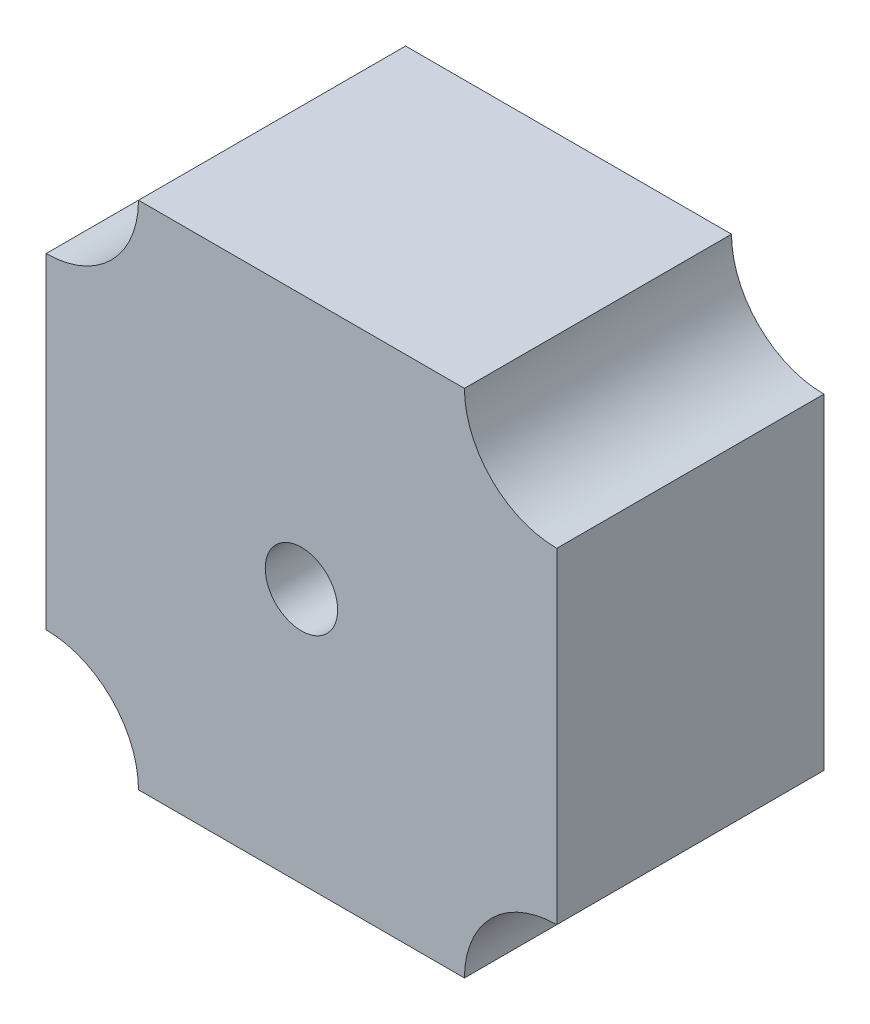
ISO-10303-21;
HEADER;
FILE_DESCRIPTION(('STEP AP214'),'2;1');
FILE_NAME('part.step','',(''),(''),'','','');
FILE_SCHEMA(('AUTOMOTIVE_DESIGN { 1 0 10303 214 1 1 1 1 }'));
ENDSEC;
DATA;
#1=APPLICATION_CONTEXT('core data for automotive mechanical design processes');
#2=APPLICATION_PROTOCOL_DEFINITION('international standard','automotive_design',2000,#1);
#3=PRODUCT_CONTEXT('',#1,'mechanical');
#4=PRODUCT('Part','Part','',(#3));
#5=PRODUCT_RELATED_PRODUCT_CATEGORY('part','',(#4));
#6=PRODUCT_DEFINITION_FORMATION('','',#4);
#7=PRODUCT_DEFINITION_CONTEXT('part definition',#1,'design');
#8=PRODUCT_DEFINITION('design','',#6,#7);
#9=PRODUCT_DEFINITION_SHAPE('','',#8);
#10=(LENGTH_UNIT() NAMED_UNIT(*) SI_UNIT(.MILLI.,.METRE.));
#11=(NAMED_UNIT(*) PLANE_ANGLE_UNIT() SI_UNIT($,.RADIAN.));
#12=(NAMED_UNIT(*) SI_UNIT($,.STERADIAN.) SOLID_ANGLE_UNIT());
#13=UNCERTAINTY_MEASURE_WITH_UNIT(LENGTH_MEASURE(1.E-05),#10,'distance_accuracy_value','');
#14=(GEOMETRIC_REPRESENTATION_CONTEXT(3) GLOBAL_UNCERTAINTY_ASSIGNED_CONTEXT((#13)) GLOBAL_UNIT_ASSIGNED_CONTEXT((#10,
#11,#12)) REPRESENTATION_CONTEXT('',''));
#15=CARTESIAN_POINT('',(0.,0.,0.));
#16=DIRECTION('',(0.,0.,1.));
#17=DIRECTION('',(1.,0.,0.));
#18=AXIS2_PLACEMENT_3D('',#15,#16,#17);
#19=CARTESIAN_POINT('',(-28.2,28.2,29.5));
#20=DIRECTION('',(0.,0.,-1.));
#21=DIRECTION('',(-1.,0.,0.));
#22=AXIS2_PLACEMENT_3D('',#19,#20,#21);
#23=CYLINDRICAL_SURFACE('',#22,10.2);
#24=CARTESIAN_POINT('',(-28.2,28.2,0.));
#25=DIRECTION('',(0.,0.,-1.));
#26=DIRECTION('',(1.,0.,0.));
#27=AXIS2_PLACEMENT_3D('',#24,#25,#26);
#28=CIRCLE('',#27,10.2);
#29=CARTESIAN_POINT('',(-18.,28.2,0.));
#30=VERTEX_POINT('',#29);
#31=CARTESIAN_POINT('',(-28.2,18.,0.));
#32=VERTEX_POINT('',#31);
#33=EDGE_CURVE('E129',#30,#32,#28,.T.);
#34=ORIENTED_EDGE('',*,*,#33,.T.);
#35=DIRECTION('',(0.,0.,-1.));
#36=VECTOR('',#35,1.);
#37=CARTESIAN_POINT('',(-28.2,18.,29.5));
#38=LINE('',#37,#36);
#39=CARTESIAN_POINT('',(-28.2,18.,29.5));
#40=VERTEX_POINT('',#39);
#41=EDGE_CURVE('E11',#40,#32,#38,.T.);
#42=ORIENTED_EDGE('',*,*,#41,.F.);
#43=CARTESIAN_POINT('',(-28.2,28.2,29.5));
#44=DIRECTION('',(0.,0.,-1.));
#45=DIRECTION('',(1.,0.,0.));
#46=AXIS2_PLACEMENT_3D('',#43,#44,#45);
#47=CIRCLE('',#46,10.2);
#48=CARTESIAN_POINT('',(-18.,28.2,29.5));
#49=VERTEX_POINT('',#48);
#50=EDGE_CURVE('E144',#49,#40,#47,.T.);
#51=ORIENTED_EDGE('',*,*,#50,.F.);
#52=DIRECTION('',(0.,0.,-1.));
#53=VECTOR('',#52,1.);
#54=CARTESIAN_POINT('',(-18.,28.2,29.5));
#55=LINE('',#54,#53);
#56=EDGE_CURVE('E125',#49,#30,#55,.T.);
#57=ORIENTED_EDGE('',*,*,#56,.T.);
#58=EDGE_LOOP('',(#34,#42,#51,#57));
#59=FACE_BOUND('',#58,.T.);
#60=ADVANCED_FACE('F33',(#59),#23,.F.);
#61=CARTESIAN_POINT('',(-28.2,-18.,29.5));
#62=DIRECTION('',(1.,0.,0.));
#63=DIRECTION('',(0.,0.,-1.));
#64=AXIS2_PLACEMENT_3D('',#61,#62,#63);
#65=PLANE('',#64);
#66=DIRECTION('',(0.,-1.,0.));
#67=VECTOR('',#66,1.);
#68=CARTESIAN_POINT('',(-28.2,-18.,0.));
#69=LINE('',#68,#67);
#70=CARTESIAN_POINT('',(-28.2,-18.,0.));
#71=VERTEX_POINT('',#70);
#72=EDGE_CURVE('E132',#32,#71,#69,.T.);
#73=ORIENTED_EDGE('',*,*,#72,.T.);
#74=DIRECTION('',(0.,0.,-1.));
#75=VECTOR('',#74,1.);
#76=CARTESIAN_POINT('',(-28.2,-18.,29.5));
#77=LINE('',#76,#75);
#78=CARTESIAN_POINT('',(-28.2,-18.,29.5));
#79=VERTEX_POINT('',#78);
#80=EDGE_CURVE('E41',#79,#71,#77,.T.);
#81=ORIENTED_EDGE('',*,*,#80,.F.);
#82=DIRECTION('',(0.,-1.,0.));
#83=VECTOR('',#82,1.);
#84=CARTESIAN_POINT('',(-28.2,-18.,29.5));
#85=LINE('',#84,#83);
#86=EDGE_CURVE('E92',#40,#79,#85,.T.);
#87=ORIENTED_EDGE('',*,*,#86,.F.);
#88=ORIENTED_EDGE('',*,*,#41,.T.);
#89=EDGE_LOOP('',(#73,#81,#87,#88));
#90=FACE_BOUND('',#89,.T.);
#91=ADVANCED_FACE('F199',(#90),#65,.F.);
#92=CARTESIAN_POINT('',(-28.2,-28.2,29.5));
#93=DIRECTION('',(0.,0.,-1.));
#94=DIRECTION('',(-1.,0.,0.));
#95=AXIS2_PLACEMENT_3D('',#92,#93,#94);
#96=CYLINDRICAL_SURFACE('',#95,10.2);
#97=CARTESIAN_POINT('',(-28.2,-28.2,0.));
#98=DIRECTION('',(0.,0.,-1.));
#99=DIRECTION('',(1.,0.,0.));
#100=AXIS2_PLACEMENT_3D('',#97,#98,#99);
#101=CIRCLE('',#100,10.2);
#102=CARTESIAN_POINT('',(-18.,-28.2,0.));
#103=VERTEX_POINT('',#102);
#104=EDGE_CURVE('E135',#71,#103,#101,.T.);
#105=ORIENTED_EDGE('',*,*,#104,.T.);
#106=DIRECTION('',(0.,0.,-1.));
#107=VECTOR('',#106,1.);
#108=CARTESIAN_POINT('',(-18.,-28.2,29.5));
#109=LINE('',#108,#107);
#110=CARTESIAN_POINT('',(-18.,-28.2,29.5));
#111=VERTEX_POINT('',#110);
#112=EDGE_CURVE('E151',#111,#103,#109,.T.);
#113=ORIENTED_EDGE('',*,*,#112,.F.);
#114=CARTESIAN_POINT('',(-28.2,-28.2,29.5));
#115=DIRECTION('',(0.,0.,-1.));
#116=DIRECTION('',(1.,0.,0.));
#117=AXIS2_PLACEMENT_3D('',#114,#115,#116);
#118=CIRCLE('',#117,10.2);
#119=EDGE_CURVE('E159',#79,#111,#118,.T.);
#120=ORIENTED_EDGE('',*,*,#119,.F.);
#121=ORIENTED_EDGE('',*,*,#80,.T.);
#122=EDGE_LOOP('',(#105,#113,#120,#121));
#123=FACE_BOUND('',#122,.T.);
#124=ADVANCED_FACE('F157',(#123),#96,.F.);
#125=CARTESIAN_POINT('',(18.,-28.2,29.5));
#126=DIRECTION('',(0.,1.,0.));
#127=DIRECTION('',(0.,0.,1.));
#128=AXIS2_PLACEMENT_3D('',#125,#126,#127);
#129=PLANE('',#128);
#130=DIRECTION('',(1.,0.,0.));
#131=VECTOR('',#130,1.);
#132=CARTESIAN_POINT('',(18.,-28.2,0.));
#133=LINE('',#132,#131);
#134=CARTESIAN_POINT('',(18.,-28.2,0.));
#135=VERTEX_POINT('',#134);
#136=EDGE_CURVE('E137',#103,#135,#133,.T.);
#137=ORIENTED_EDGE('',*,*,#136,.T.);
#138=DIRECTION('',(0.,0.,-1.));
#139=VECTOR('',#138,1.);
#140=CARTESIAN_POINT('',(18.,-28.2,29.5));
#141=LINE('',#140,#139);
#142=CARTESIAN_POINT('',(18.,-28.2,29.5));
#143=VERTEX_POINT('',#142);
#144=EDGE_CURVE('E148',#143,#135,#141,.T.);
#145=ORIENTED_EDGE('',*,*,#144,.F.);
#146=DIRECTION('',(1.,0.,0.));
#147=VECTOR('',#146,1.);
#148=CARTESIAN_POINT('',(18.,-28.2,29.5));
#149=LINE('',#148,#147);
#150=EDGE_CURVE('E171',#111,#143,#149,.T.);
#151=ORIENTED_EDGE('',*,*,#150,.F.);
#152=ORIENTED_EDGE('',*,*,#112,.T.);
#153=EDGE_LOOP('',(#137,#145,#151,#152));
#154=FACE_BOUND('',#153,.T.);
#155=ADVANCED_FACE('F167',(#154),#129,.F.);
#156=CARTESIAN_POINT('',(28.2,-28.2,29.5));
#157=DIRECTION('',(0.,0.,-1.));
#158=DIRECTION('',(-1.,0.,0.));
#159=AXIS2_PLACEMENT_3D('',#156,#157,#158);
#160=CYLINDRICAL_SURFACE('',#159,10.2);
#161=CARTESIAN_POINT('',(28.2,-28.2,0.));
#162=DIRECTION('',(0.,0.,-1.));
#163=DIRECTION('',(1.,0.,0.));
#164=AXIS2_PLACEMENT_3D('',#161,#162,#163);
#165=CIRCLE('',#164,10.2);
#166=CARTESIAN_POINT('',(28.2,-18.,0.));
#167=VERTEX_POINT('',#166);
#168=EDGE_CURVE('E139',#135,#167,#165,.T.);
#169=ORIENTED_EDGE('',*,*,#168,.T.);
#170=DIRECTION('',(0.,0.,-1.));
#171=VECTOR('',#170,1.);
#172=CARTESIAN_POINT('',(28.2,-18.,29.5));
#173=LINE('',#172,#171);
#174=CARTESIAN_POINT('',(28.2,-18.,29.5));
#175=VERTEX_POINT('',#174);
#176=EDGE_CURVE('E120',#175,#167,#173,.T.);
#177=ORIENTED_EDGE('',*,*,#176,.F.);
#178=CARTESIAN_POINT('',(28.2,-28.2,29.5));
#179=DIRECTION('',(0.,0.,-1.));
#180=DIRECTION('',(1.,0.,0.));
#181=AXIS2_PLACEMENT_3D('',#178,#179,#180);
#182=CIRCLE('',#181,10.2);
#183=EDGE_CURVE('E111',#143,#175,#182,.T.);
#184=ORIENTED_EDGE('',*,*,#183,.F.);
#185=ORIENTED_EDGE('',*,*,#144,.T.);
#186=EDGE_LOOP('',(#169,#177,#184,#185));
#187=FACE_BOUND('',#186,.T.);
#188=ADVANCED_FACE('F170',(#187),#160,.F.);
#189=CARTESIAN_POINT('',(28.2,-18.,29.5));
#190=DIRECTION('',(-1.,0.,0.));
#191=DIRECTION('',(0.,0.,1.));
#192=AXIS2_PLACEMENT_3D('',#189,#190,#191);
#193=PLANE('',#192);
#194=DIRECTION('',(0.,1.,0.));
#195=VECTOR('',#194,1.);
#196=CARTESIAN_POINT('',(28.2,-18.,0.));
#197=LINE('',#196,#195);
#198=CARTESIAN_POINT('',(28.2,18.,0.));
#199=VERTEX_POINT('',#198);
#200=EDGE_CURVE('E119',#167,#199,#197,.T.);
#201=ORIENTED_EDGE('',*,*,#200,.T.);
#202=DIRECTION('',(0.,0.,-1.));
#203=VECTOR('',#202,1.);
#204=CARTESIAN_POINT('',(28.2,18.,29.5));
#205=LINE('',#204,#203);
#206=CARTESIAN_POINT('',(28.2,18.,29.5));
#207=VERTEX_POINT('',#206);
#208=EDGE_CURVE('E116',#207,#199,#205,.T.);
#209=ORIENTED_EDGE('',*,*,#208,.F.);
#210=DIRECTION('',(0.,1.,0.));
#211=VECTOR('',#210,1.);
#212=CARTESIAN_POINT('',(28.2,-18.,29.5));
#213=LINE('',#212,#211);
#214=EDGE_CURVE('E105',#175,#207,#213,.T.);
#215=ORIENTED_EDGE('',*,*,#214,.F.);
#216=ORIENTED_EDGE('',*,*,#176,.T.);
#217=EDGE_LOOP('',(#201,#209,#215,#216));
#218=FACE_BOUND('',#217,.T.);
#219=ADVANCED_FACE('F117',(#218),#193,.F.);
#220=CARTESIAN_POINT('',(28.2,28.2,29.5));
#221=DIRECTION('',(0.,0.,-1.));
#222=DIRECTION('',(-1.,0.,0.));
#223=AXIS2_PLACEMENT_3D('',#220,#221,#222);
#224=CYLINDRICAL_SURFACE('',#223,10.2);
#225=CARTESIAN_POINT('',(28.2,28.2,0.));
#226=DIRECTION('',(0.,0.,-1.));
#227=DIRECTION('',(1.,0.,0.));
#228=AXIS2_PLACEMENT_3D('',#225,#226,#227);
#229=CIRCLE('',#228,10.2);
#230=CARTESIAN_POINT('',(18.,28.2,0.));
#231=VERTEX_POINT('',#230);
#232=EDGE_CURVE('E78',#199,#231,#229,.T.);
#233=ORIENTED_EDGE('',*,*,#232,.T.);
#234=DIRECTION('',(0.,0.,-1.));
#235=VECTOR('',#234,1.);
#236=CARTESIAN_POINT('',(18.,28.2,29.5));
#237=LINE('',#236,#235);
#238=CARTESIAN_POINT('',(18.,28.2,29.5));
#239=VERTEX_POINT('',#238);
#240=EDGE_CURVE('E121',#239,#231,#237,.T.);
#241=ORIENTED_EDGE('',*,*,#240,.F.);
#242=CARTESIAN_POINT('',(28.2,28.2,29.5));
#243=DIRECTION('',(0.,0.,-1.));
#244=DIRECTION('',(1.,0.,0.));
#245=AXIS2_PLACEMENT_3D('',#242,#243,#244);
#246=CIRCLE('',#245,10.2);
#247=EDGE_CURVE('E109',#207,#239,#246,.T.);
#248=ORIENTED_EDGE('',*,*,#247,.F.);
#249=ORIENTED_EDGE('',*,*,#208,.T.);
#250=EDGE_LOOP('',(#233,#241,#248,#249));
#251=FACE_BOUND('',#250,.T.);
#252=ADVANCED_FACE('F123',(#251),#224,.F.);
#253=CARTESIAN_POINT('',(18.,28.2,29.5));
#254=DIRECTION('',(0.,-1.,0.));
#255=DIRECTION('',(0.,0.,-1.));
#256=AXIS2_PLACEMENT_3D('',#253,#254,#255);
#257=PLANE('',#256);
#258=DIRECTION('',(-1.,0.,0.));
#259=VECTOR('',#258,1.);
#260=CARTESIAN_POINT('',(18.,28.2,0.));
#261=LINE('',#260,#259);
#262=EDGE_CURVE('E84',#231,#30,#261,.T.);
#263=ORIENTED_EDGE('',*,*,#262,.T.);
#264=ORIENTED_EDGE('',*,*,#56,.F.);
#265=DIRECTION('',(-1.,0.,0.));
#266=VECTOR('',#265,1.);
#267=CARTESIAN_POINT('',(18.,28.2,29.5));
#268=LINE('',#267,#266);
#269=EDGE_CURVE('E49',#239,#49,#268,.T.);
#270=ORIENTED_EDGE('',*,*,#269,.F.);
#271=ORIENTED_EDGE('',*,*,#240,.T.);
#272=EDGE_LOOP('',(#263,#264,#270,#271));
#273=FACE_BOUND('',#272,.T.);
#274=ADVANCED_FACE('F195',(#273),#257,.F.);
#275=CARTESIAN_POINT('',(-28.2,28.2,29.5));
#276=DIRECTION('',(0.,0.,1.));
#277=DIRECTION('',(1.,0.,0.));
#278=AXIS2_PLACEMENT_3D('',#275,#276,#277);
#279=PLANE('',#278);
#280=CARTESIAN_POINT('',(0.,0.,29.5));
#281=DIRECTION('',(0.,0.,-1.));
#282=DIRECTION('',(-1.,0.,0.));
#283=AXIS2_PLACEMENT_3D('',#280,#281,#282);
#284=CIRCLE('',#283,4.);
#285=CARTESIAN_POINT('',(-4.,0.,29.5));
#286=VERTEX_POINT('',#285);
#287=EDGE_CURVE('E133',#286,#286,#284,.T.);
#288=ORIENTED_EDGE('',*,*,#287,.T.);
#289=EDGE_LOOP('',(#288));
#290=FACE_BOUND('',#289,.T.);
#291=ORIENTED_EDGE('',*,*,#50,.T.);
#292=ORIENTED_EDGE('',*,*,#86,.T.);
#293=ORIENTED_EDGE('',*,*,#119,.T.);
#294=ORIENTED_EDGE('',*,*,#150,.T.);
#295=ORIENTED_EDGE('',*,*,#183,.T.);
#296=ORIENTED_EDGE('',*,*,#214,.T.);
#297=ORIENTED_EDGE('',*,*,#247,.T.);
#298=ORIENTED_EDGE('',*,*,#269,.T.);
#299=EDGE_LOOP('',(#291,#292,#293,#294,#295,#296,#297,#298));
#300=FACE_BOUND('',#299,.T.);
#301=ADVANCED_FACE('F107',(#290,#300),#279,.T.);
#302=CARTESIAN_POINT('',(-28.2,28.2,0.));
#303=DIRECTION('',(0.,0.,1.));
#304=DIRECTION('',(1.,0.,0.));
#305=AXIS2_PLACEMENT_3D('',#302,#303,#304);
#306=PLANE('',#305);
#307=CARTESIAN_POINT('',(0.,0.,0.));
#308=DIRECTION('',(0.,0.,-1.));
#309=DIRECTION('',(-1.,0.,0.));
#310=AXIS2_PLACEMENT_3D('',#307,#308,#309);
#311=CIRCLE('',#310,4.);
#312=CARTESIAN_POINT('',(-4.,0.,0.));
#313=VERTEX_POINT('',#312);
#314=EDGE_CURVE('E177',#313,#313,#311,.T.);
#315=ORIENTED_EDGE('',*,*,#314,.F.);
#316=EDGE_LOOP('',(#315));
#317=FACE_BOUND('',#316,.T.);
#318=ORIENTED_EDGE('',*,*,#33,.F.);
#319=ORIENTED_EDGE('',*,*,#262,.F.);
#320=ORIENTED_EDGE('',*,*,#232,.F.);
#321=ORIENTED_EDGE('',*,*,#200,.F.);
#322=ORIENTED_EDGE('',*,*,#168,.F.);
#323=ORIENTED_EDGE('',*,*,#136,.F.);
#324=ORIENTED_EDGE('',*,*,#104,.F.);
#325=ORIENTED_EDGE('',*,*,#72,.F.);
#326=EDGE_LOOP('',(#318,#319,#320,#321,#322,#323,#324,#325));
#327=FACE_BOUND('',#326,.T.);
#328=ADVANCED_FACE('F163',(#317,#327),#306,.F.);
#329=CARTESIAN_POINT('',(0.,0.,29.5));
#330=DIRECTION('',(0.,0.,-1.));
#331=DIRECTION('',(-1.,0.,0.));
#332=AXIS2_PLACEMENT_3D('',#329,#330,#331);
#333=CYLINDRICAL_SURFACE('',#332,4.);
#334=ORIENTED_EDGE('',*,*,#287,.F.);
#335=EDGE_LOOP('',(#334));
#336=FACE_BOUND('',#335,.T.);
#337=ORIENTED_EDGE('',*,*,#314,.T.);
#338=EDGE_LOOP('',(#337));
#339=FACE_BOUND('',#338,.T.);
#340=ADVANCED_FACE('F184',(#336,#339),#333,.F.);
#341=CLOSED_SHELL('',(#60,#91,#124,#155,#188,#219,#252,#274,#301,#328,#340));
#342=MANIFOLD_SOLID_BREP('B2',#341);
#343=ADVANCED_BREP_SHAPE_REPRESENTATION('',(#18,#342),#14);
#344=SHAPE_DEFINITION_REPRESENTATION(#9,#343);
ENDSEC;
END-ISO-10303-21;
